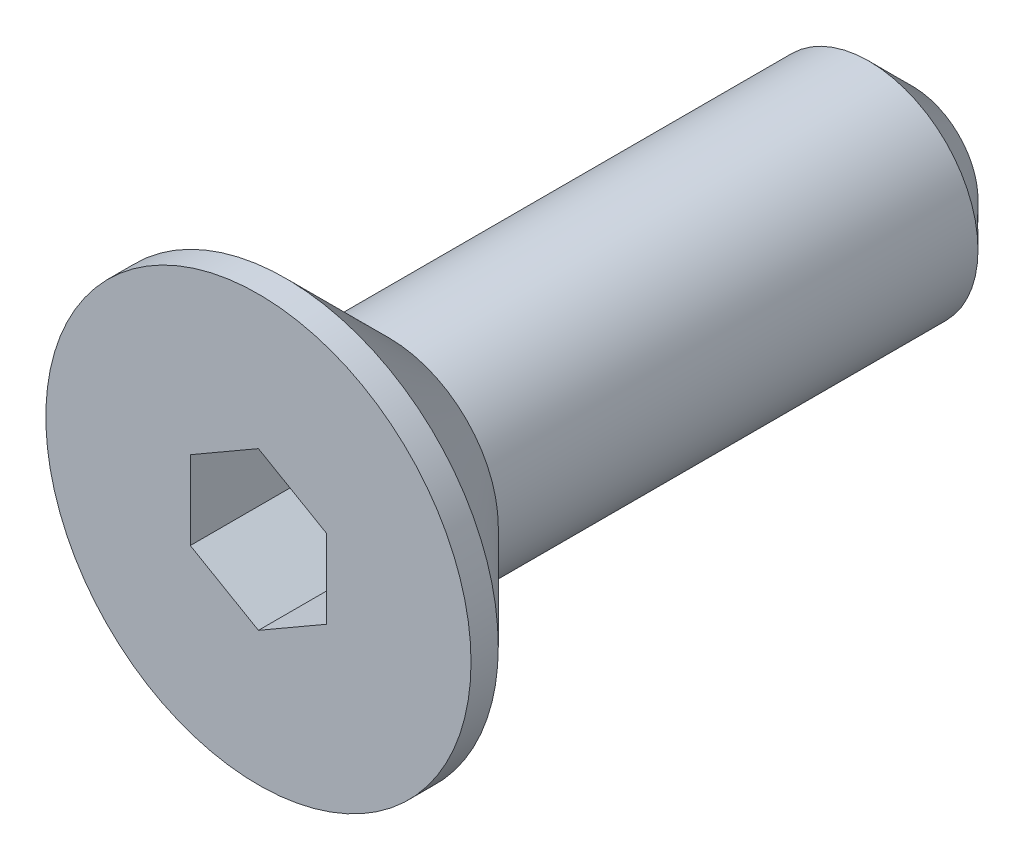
ISO-10303-21;
HEADER;
FILE_DESCRIPTION(('STEP AP214'),'2;1');
FILE_NAME('part.step','',(''),(''),'','','');
FILE_SCHEMA(('AUTOMOTIVE_DESIGN { 1 0 10303 214 1 1 1 1 }'));
ENDSEC;
DATA;
#1=APPLICATION_CONTEXT('core data for automotive mechanical design processes');
#2=APPLICATION_PROTOCOL_DEFINITION('international standard','automotive_design',2000,#1);
#3=PRODUCT_CONTEXT('',#1,'mechanical');
#4=PRODUCT('Part','Part','',(#3));
#5=PRODUCT_RELATED_PRODUCT_CATEGORY('part','',(#4));
#6=PRODUCT_DEFINITION_FORMATION('','',#4);
#7=PRODUCT_DEFINITION_CONTEXT('part definition',#1,'design');
#8=PRODUCT_DEFINITION('design','',#6,#7);
#9=PRODUCT_DEFINITION_SHAPE('','',#8);
#10=(LENGTH_UNIT() NAMED_UNIT(*) SI_UNIT(.MILLI.,.METRE.));
#11=(NAMED_UNIT(*) PLANE_ANGLE_UNIT() SI_UNIT($,.RADIAN.));
#12=(NAMED_UNIT(*) SI_UNIT($,.STERADIAN.) SOLID_ANGLE_UNIT());
#13=UNCERTAINTY_MEASURE_WITH_UNIT(LENGTH_MEASURE(1.E-05),#10,'distance_accuracy_value','');
#14=(GEOMETRIC_REPRESENTATION_CONTEXT(3) GLOBAL_UNCERTAINTY_ASSIGNED_CONTEXT((#13)) GLOBAL_UNIT_ASSIGNED_CONTEXT((#10,
#11,#12)) REPRESENTATION_CONTEXT('',''));
#15=CARTESIAN_POINT('',(0.,0.,0.));
#16=DIRECTION('',(0.,0.,1.));
#17=DIRECTION('',(1.,0.,0.));
#18=AXIS2_PLACEMENT_3D('',#15,#16,#17);
#19=CARTESIAN_POINT('',(0.,0.,0.));
#20=DIRECTION('',(0.,0.,1.));
#21=DIRECTION('',(1.,0.,0.));
#22=AXIS2_PLACEMENT_3D('',#19,#20,#21);
#23=PLANE('',#22);
#24=DIRECTION('',(0.866025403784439,-0.5,0.));
#25=VECTOR('',#24,1.);
#26=CARTESIAN_POINT('',(-1.25,-0.721687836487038,0.));
#27=LINE('',#26,#25);
#28=CARTESIAN_POINT('',(-1.25,-0.721687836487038,0.));
#29=VERTEX_POINT('',#28);
#30=CARTESIAN_POINT('',(0.,-1.44337567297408,0.));
#31=VERTEX_POINT('',#30);
#32=EDGE_CURVE('E29',#29,#31,#27,.T.);
#33=ORIENTED_EDGE('',*,*,#32,.F.);
#34=DIRECTION('',(0.,-1.,0.));
#35=VECTOR('',#34,1.);
#36=CARTESIAN_POINT('',(-1.25,0.721687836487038,0.));
#37=LINE('',#36,#35);
#38=CARTESIAN_POINT('',(-1.25,0.721687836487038,0.));
#39=VERTEX_POINT('',#38);
#40=EDGE_CURVE('E98',#39,#29,#37,.T.);
#41=ORIENTED_EDGE('',*,*,#40,.F.);
#42=DIRECTION('',(-0.866025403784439,-0.5,0.));
#43=VECTOR('',#42,1.);
#44=CARTESIAN_POINT('',(0.,1.44337567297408,0.));
#45=LINE('',#44,#43);
#46=CARTESIAN_POINT('',(0.,1.44337567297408,0.));
#47=VERTEX_POINT('',#46);
#48=EDGE_CURVE('E92',#47,#39,#45,.T.);
#49=ORIENTED_EDGE('',*,*,#48,.F.);
#50=DIRECTION('',(-0.866025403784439,0.5,0.));
#51=VECTOR('',#50,1.);
#52=CARTESIAN_POINT('',(1.25,0.721687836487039,0.));
#53=LINE('',#52,#51);
#54=CARTESIAN_POINT('',(1.25,0.721687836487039,0.));
#55=VERTEX_POINT('',#54);
#56=EDGE_CURVE('E90',#55,#47,#53,.T.);
#57=ORIENTED_EDGE('',*,*,#56,.F.);
#58=DIRECTION('',(0.,1.,0.));
#59=VECTOR('',#58,1.);
#60=CARTESIAN_POINT('',(1.25,-0.721687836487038,0.));
#61=LINE('',#60,#59);
#62=CARTESIAN_POINT('',(1.25,-0.721687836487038,0.));
#63=VERTEX_POINT('',#62);
#64=EDGE_CURVE('E72',#63,#55,#61,.T.);
#65=ORIENTED_EDGE('',*,*,#64,.F.);
#66=DIRECTION('',(0.866025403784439,0.5,0.));
#67=VECTOR('',#66,1.);
#68=CARTESIAN_POINT('',(0.,-1.44337567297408,0.));
#69=LINE('',#68,#67);
#70=EDGE_CURVE('E83',#31,#63,#69,.T.);
#71=ORIENTED_EDGE('',*,*,#70,.F.);
#72=EDGE_LOOP('',(#33,#41,#49,#57,#65,#71));
#73=FACE_BOUND('',#72,.T.);
#74=CARTESIAN_POINT('',(0.,0.,0.));
#75=DIRECTION('',(0.,0.,1.));
#76=DIRECTION('',(1.,0.,0.));
#77=AXIS2_PLACEMENT_3D('',#74,#75,#76);
#78=CIRCLE('',#77,3.9);
#79=CARTESIAN_POINT('',(3.9,0.,0.));
#80=VERTEX_POINT('',#79);
#81=EDGE_CURVE('E128',#80,#80,#78,.T.);
#82=ORIENTED_EDGE('',*,*,#81,.T.);
#83=EDGE_LOOP('',(#82));
#84=FACE_BOUND('',#83,.T.);
#85=ADVANCED_FACE('F14',(#73,#84),#23,.T.);
#86=CARTESIAN_POINT('',(0.,0.,6.05968084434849));
#87=DIRECTION('',(0.,0.,1.));
#88=DIRECTION('',(1.,0.,0.));
#89=AXIS2_PLACEMENT_3D('',#86,#87,#88);
#90=CYLINDRICAL_SURFACE('',#89,3.9);
#91=CARTESIAN_POINT('',(0.,0.,-0.5));
#92=DIRECTION('',(0.,0.,1.));
#93=DIRECTION('',(1.,0.,0.));
#94=AXIS2_PLACEMENT_3D('',#91,#92,#93);
#95=CIRCLE('',#94,3.9);
#96=CARTESIAN_POINT('',(3.9,0.,-0.5));
#97=VERTEX_POINT('',#96);
#98=EDGE_CURVE('E125',#97,#97,#95,.T.);
#99=ORIENTED_EDGE('',*,*,#98,.T.);
#100=EDGE_LOOP('',(#99));
#101=FACE_BOUND('',#100,.T.);
#102=ORIENTED_EDGE('',*,*,#81,.F.);
#103=EDGE_LOOP('',(#102));
#104=FACE_BOUND('',#103,.T.);
#105=ADVANCED_FACE('F148',(#101,#104),#90,.T.);
#106=CARTESIAN_POINT('',(0.,0.,-0.5));
#107=DIRECTION('',(0.,0.,1.));
#108=DIRECTION('',(1.,0.,0.));
#109=AXIS2_PLACEMENT_3D('',#106,#107,#108);
#110=CONICAL_SURFACE('',#109,3.9,0.78539816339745);
#111=CARTESIAN_POINT('',(0.,0.,-2.4));
#112=DIRECTION('',(0.,0.,1.));
#113=DIRECTION('',(1.,0.,0.));
#114=AXIS2_PLACEMENT_3D('',#111,#112,#113);
#115=CIRCLE('',#114,2.);
#116=CARTESIAN_POINT('',(2.,0.,-2.4));
#117=VERTEX_POINT('',#116);
#118=EDGE_CURVE('E116',#117,#117,#115,.T.);
#119=ORIENTED_EDGE('',*,*,#118,.T.);
#120=EDGE_LOOP('',(#119));
#121=FACE_BOUND('',#120,.T.);
#122=ORIENTED_EDGE('',*,*,#98,.F.);
#123=EDGE_LOOP('',(#122));
#124=FACE_BOUND('',#123,.T.);
#125=ADVANCED_FACE('F153',(#121,#124),#110,.T.);
#126=CARTESIAN_POINT('',(0.,0.,6.05968084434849));
#127=DIRECTION('',(0.,0.,1.));
#128=DIRECTION('',(1.,0.,0.));
#129=AXIS2_PLACEMENT_3D('',#126,#127,#128);
#130=CYLINDRICAL_SURFACE('',#129,2.);
#131=CARTESIAN_POINT('',(0.,0.,-11.2));
#132=DIRECTION('',(0.,0.,-1.));
#133=DIRECTION('',(-1.,0.,0.));
#134=AXIS2_PLACEMENT_3D('',#131,#132,#133);
#135=CIRCLE('',#134,2.);
#136=CARTESIAN_POINT('',(-2.,0.,-11.2));
#137=VERTEX_POINT('',#136);
#138=EDGE_CURVE('E22',#137,#137,#135,.F.);
#139=ORIENTED_EDGE('',*,*,#138,.T.);
#140=EDGE_LOOP('',(#139));
#141=FACE_BOUND('',#140,.T.);
#142=ORIENTED_EDGE('',*,*,#118,.F.);
#143=EDGE_LOOP('',(#142));
#144=FACE_BOUND('',#143,.T.);
#145=ADVANCED_FACE('F133',(#141,#144),#130,.T.);
#146=CARTESIAN_POINT('',(2.,0.,-12.));
#147=DIRECTION('',(0.,0.,-1.));
#148=DIRECTION('',(-1.,0.,0.));
#149=AXIS2_PLACEMENT_3D('',#146,#147,#148);
#150=PLANE('',#149);
#151=CARTESIAN_POINT('',(0.,0.,-12.));
#152=DIRECTION('',(0.,0.,-1.));
#153=DIRECTION('',(-1.,0.,0.));
#154=AXIS2_PLACEMENT_3D('',#151,#152,#153);
#155=CIRCLE('',#154,1.2);
#156=CARTESIAN_POINT('',(-1.2,0.,-12.));
#157=VERTEX_POINT('',#156);
#158=EDGE_CURVE('E9',#157,#157,#155,.T.);
#159=ORIENTED_EDGE('',*,*,#158,.T.);
#160=EDGE_LOOP('',(#159));
#161=FACE_BOUND('',#160,.T.);
#162=ADVANCED_FACE('F162',(#161),#150,.T.);
#163=CARTESIAN_POINT('',(-1.25,-0.721687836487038,-2.));
#164=DIRECTION('',(-0.5,-0.866025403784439,0.));
#165=DIRECTION('',(0.866025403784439,-0.5,0.));
#166=AXIS2_PLACEMENT_3D('',#163,#164,#165);
#167=PLANE('',#166);
#168=ORIENTED_EDGE('',*,*,#32,.T.);
#169=DIRECTION('',(0.,0.,1.));
#170=VECTOR('',#169,1.);
#171=CARTESIAN_POINT('',(0.,-1.44337567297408,-2.));
#172=LINE('',#171,#170);
#173=CARTESIAN_POINT('',(0.,-1.44337567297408,-2.));
#174=VERTEX_POINT('',#173);
#175=EDGE_CURVE('E80',#174,#31,#172,.T.);
#176=ORIENTED_EDGE('',*,*,#175,.F.);
#177=DIRECTION('',(0.866025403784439,-0.5,0.));
#178=VECTOR('',#177,1.);
#179=CARTESIAN_POINT('',(-1.25,-0.721687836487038,-2.));
#180=LINE('',#179,#178);
#181=CARTESIAN_POINT('',(-1.25,-0.721687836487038,-2.));
#182=VERTEX_POINT('',#181);
#183=EDGE_CURVE('E100',#182,#174,#180,.T.);
#184=ORIENTED_EDGE('',*,*,#183,.F.);
#185=DIRECTION('',(0.,0.,1.));
#186=VECTOR('',#185,1.);
#187=CARTESIAN_POINT('',(-1.25,-0.721687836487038,-2.));
#188=LINE('',#187,#186);
#189=EDGE_CURVE('E36',#182,#29,#188,.T.);
#190=ORIENTED_EDGE('',*,*,#189,.T.);
#191=EDGE_LOOP('',(#168,#176,#184,#190));
#192=FACE_BOUND('',#191,.T.);
#193=ADVANCED_FACE('F165',(#192),#167,.F.);
#194=CARTESIAN_POINT('',(-1.25,0.721687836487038,-2.));
#195=DIRECTION('',(-1.,0.,0.));
#196=DIRECTION('',(0.,0.,1.));
#197=AXIS2_PLACEMENT_3D('',#194,#195,#196);
#198=PLANE('',#197);
#199=ORIENTED_EDGE('',*,*,#40,.T.);
#200=ORIENTED_EDGE('',*,*,#189,.F.);
#201=DIRECTION('',(0.,-1.,0.));
#202=VECTOR('',#201,1.);
#203=CARTESIAN_POINT('',(-1.25,0.721687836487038,-2.));
#204=LINE('',#203,#202);
#205=CARTESIAN_POINT('',(-1.25,0.721687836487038,-2.));
#206=VERTEX_POINT('',#205);
#207=EDGE_CURVE('E112',#206,#182,#204,.T.);
#208=ORIENTED_EDGE('',*,*,#207,.F.);
#209=DIRECTION('',(0.,0.,1.));
#210=VECTOR('',#209,1.);
#211=CARTESIAN_POINT('',(-1.25,0.721687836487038,-2.));
#212=LINE('',#211,#210);
#213=EDGE_CURVE('E117',#206,#39,#212,.T.);
#214=ORIENTED_EDGE('',*,*,#213,.T.);
#215=EDGE_LOOP('',(#199,#200,#208,#214));
#216=FACE_BOUND('',#215,.T.);
#217=ADVANCED_FACE('F169',(#216),#198,.F.);
#218=CARTESIAN_POINT('',(0.,1.44337567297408,-2.));
#219=DIRECTION('',(-0.5,0.866025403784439,0.));
#220=DIRECTION('',(-0.866025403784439,-0.5,0.));
#221=AXIS2_PLACEMENT_3D('',#218,#219,#220);
#222=PLANE('',#221);
#223=ORIENTED_EDGE('',*,*,#48,.T.);
#224=ORIENTED_EDGE('',*,*,#213,.F.);
#225=DIRECTION('',(-0.866025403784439,-0.5,0.));
#226=VECTOR('',#225,1.);
#227=CARTESIAN_POINT('',(0.,1.44337567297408,-2.));
#228=LINE('',#227,#226);
#229=CARTESIAN_POINT('',(0.,1.44337567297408,-2.));
#230=VERTEX_POINT('',#229);
#231=EDGE_CURVE('E109',#230,#206,#228,.T.);
#232=ORIENTED_EDGE('',*,*,#231,.F.);
#233=DIRECTION('',(0.,0.,1.));
#234=VECTOR('',#233,1.);
#235=CARTESIAN_POINT('',(0.,1.44337567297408,-2.));
#236=LINE('',#235,#234);
#237=EDGE_CURVE('E119',#230,#47,#236,.T.);
#238=ORIENTED_EDGE('',*,*,#237,.T.);
#239=EDGE_LOOP('',(#223,#224,#232,#238));
#240=FACE_BOUND('',#239,.T.);
#241=ADVANCED_FACE('F177',(#240),#222,.F.);
#242=CARTESIAN_POINT('',(1.25,0.721687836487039,-2.));
#243=DIRECTION('',(0.5,0.866025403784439,0.));
#244=DIRECTION('',(-0.866025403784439,0.5,0.));
#245=AXIS2_PLACEMENT_3D('',#242,#243,#244);
#246=PLANE('',#245);
#247=ORIENTED_EDGE('',*,*,#56,.T.);
#248=ORIENTED_EDGE('',*,*,#237,.F.);
#249=DIRECTION('',(-0.866025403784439,0.5,0.));
#250=VECTOR('',#249,1.);
#251=CARTESIAN_POINT('',(1.25,0.721687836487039,-2.));
#252=LINE('',#251,#250);
#253=CARTESIAN_POINT('',(1.25,0.721687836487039,-2.));
#254=VERTEX_POINT('',#253);
#255=EDGE_CURVE('E106',#254,#230,#252,.T.);
#256=ORIENTED_EDGE('',*,*,#255,.F.);
#257=DIRECTION('',(0.,0.,1.));
#258=VECTOR('',#257,1.);
#259=CARTESIAN_POINT('',(1.25,0.721687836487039,-2.));
#260=LINE('',#259,#258);
#261=EDGE_CURVE('E79',#254,#55,#260,.T.);
#262=ORIENTED_EDGE('',*,*,#261,.T.);
#263=EDGE_LOOP('',(#247,#248,#256,#262));
#264=FACE_BOUND('',#263,.T.);
#265=ADVANCED_FACE('F174',(#264),#246,.F.);
#266=CARTESIAN_POINT('',(1.25,-0.721687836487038,-2.));
#267=DIRECTION('',(1.,0.,0.));
#268=DIRECTION('',(0.,1.,0.));
#269=AXIS2_PLACEMENT_3D('',#266,#267,#268);
#270=PLANE('',#269);
#271=ORIENTED_EDGE('',*,*,#64,.T.);
#272=ORIENTED_EDGE('',*,*,#261,.F.);
#273=DIRECTION('',(0.,1.,0.));
#274=VECTOR('',#273,1.);
#275=CARTESIAN_POINT('',(1.25,-0.721687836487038,-2.));
#276=LINE('',#275,#274);
#277=CARTESIAN_POINT('',(1.25,-0.721687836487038,-2.));
#278=VERTEX_POINT('',#277);
#279=EDGE_CURVE('E75',#278,#254,#276,.T.);
#280=ORIENTED_EDGE('',*,*,#279,.F.);
#281=DIRECTION('',(0.,0.,1.));
#282=VECTOR('',#281,1.);
#283=CARTESIAN_POINT('',(1.25,-0.721687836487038,-2.));
#284=LINE('',#283,#282);
#285=EDGE_CURVE('E68',#278,#63,#284,.T.);
#286=ORIENTED_EDGE('',*,*,#285,.T.);
#287=EDGE_LOOP('',(#271,#272,#280,#286));
#288=FACE_BOUND('',#287,.T.);
#289=ADVANCED_FACE('F70',(#288),#270,.F.);
#290=CARTESIAN_POINT('',(0.,-1.44337567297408,-2.));
#291=DIRECTION('',(0.5,-0.866025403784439,0.));
#292=DIRECTION('',(0.866025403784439,0.5,0.));
#293=AXIS2_PLACEMENT_3D('',#290,#291,#292);
#294=PLANE('',#293);
#295=ORIENTED_EDGE('',*,*,#70,.T.);
#296=ORIENTED_EDGE('',*,*,#285,.F.);
#297=DIRECTION('',(0.866025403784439,0.5,0.));
#298=VECTOR('',#297,1.);
#299=CARTESIAN_POINT('',(0.,-1.44337567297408,-2.));
#300=LINE('',#299,#298);
#301=EDGE_CURVE('E103',#174,#278,#300,.T.);
#302=ORIENTED_EDGE('',*,*,#301,.F.);
#303=ORIENTED_EDGE('',*,*,#175,.T.);
#304=EDGE_LOOP('',(#295,#296,#302,#303));
#305=FACE_BOUND('',#304,.T.);
#306=ADVANCED_FACE('F84',(#305),#294,.F.);
#307=CARTESIAN_POINT('',(0.,-1.44337567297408,-2.));
#308=DIRECTION('',(0.,0.,1.));
#309=DIRECTION('',(1.,0.,0.));
#310=AXIS2_PLACEMENT_3D('',#307,#308,#309);
#311=PLANE('',#310);
#312=ORIENTED_EDGE('',*,*,#183,.T.);
#313=ORIENTED_EDGE('',*,*,#301,.T.);
#314=ORIENTED_EDGE('',*,*,#279,.T.);
#315=ORIENTED_EDGE('',*,*,#255,.T.);
#316=ORIENTED_EDGE('',*,*,#231,.T.);
#317=ORIENTED_EDGE('',*,*,#207,.T.);
#318=EDGE_LOOP('',(#312,#313,#314,#315,#316,#317));
#319=FACE_BOUND('',#318,.T.);
#320=ADVANCED_FACE('F137',(#319),#311,.T.);
#321=CARTESIAN_POINT('',(0.,0.,-11.2));
#322=DIRECTION('',(0.,0.,1.));
#323=DIRECTION('',(1.,0.,0.));
#324=AXIS2_PLACEMENT_3D('',#321,#322,#323);
#325=CONICAL_SURFACE('',#324,2.,0.785398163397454);
#326=ORIENTED_EDGE('',*,*,#158,.F.);
#327=EDGE_LOOP('',(#326));
#328=FACE_BOUND('',#327,.T.);
#329=ORIENTED_EDGE('',*,*,#138,.F.);
#330=EDGE_LOOP('',(#329));
#331=FACE_BOUND('',#330,.T.);
#332=ADVANCED_FACE('F16',(#328,#331),#325,.T.);
#333=CLOSED_SHELL('',(#85,#105,#125,#145,#162,#193,#217,#241,#265,#289,#306,#320,#332));
#334=MANIFOLD_SOLID_BREP('B1',#333);
#335=ADVANCED_BREP_SHAPE_REPRESENTATION('',(#18,#334),#14);
#336=SHAPE_DEFINITION_REPRESENTATION(#9,#335);
ENDSEC;
END-ISO-10303-21;
